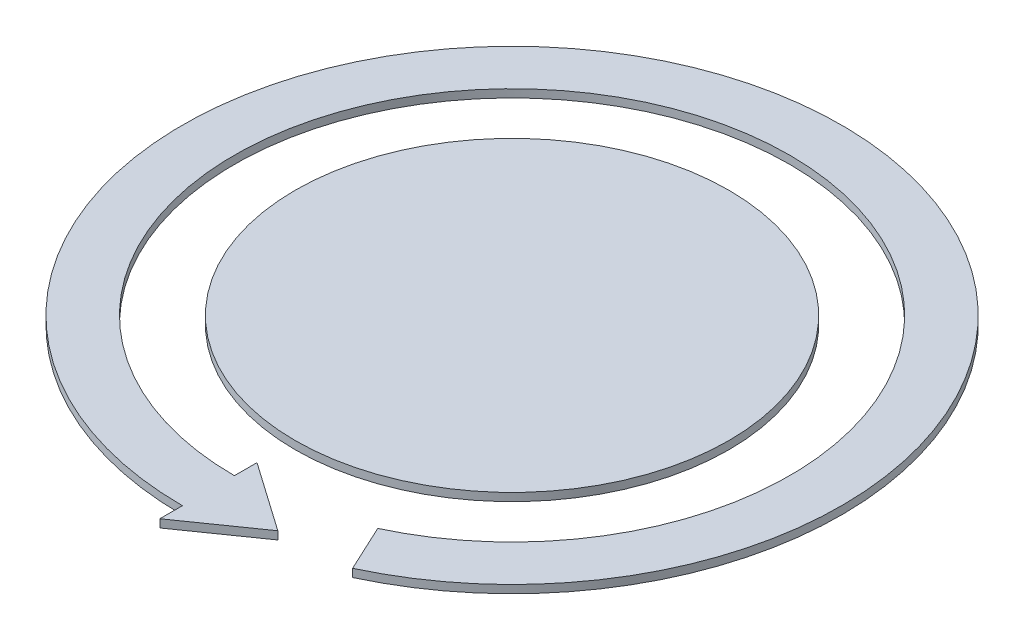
ISO-10303-21;
HEADER;
FILE_DESCRIPTION(('STEP AP214'),'2;1');
FILE_NAME('part.step','',(''),(''),'','','');
FILE_SCHEMA(('AUTOMOTIVE_DESIGN { 1 0 10303 214 1 1 1 1 }'));
ENDSEC;
DATA;
#1=APPLICATION_CONTEXT('core data for automotive mechanical design processes');
#2=APPLICATION_PROTOCOL_DEFINITION('international standard','automotive_design',2000,#1);
#3=PRODUCT_CONTEXT('',#1,'mechanical');
#4=PRODUCT('Part','Part','',(#3));
#5=PRODUCT_RELATED_PRODUCT_CATEGORY('part','',(#4));
#6=PRODUCT_DEFINITION_FORMATION('','',#4);
#7=PRODUCT_DEFINITION_CONTEXT('part definition',#1,'design');
#8=PRODUCT_DEFINITION('design','',#6,#7);
#9=PRODUCT_DEFINITION_SHAPE('','',#8);
#10=(LENGTH_UNIT() NAMED_UNIT(*) SI_UNIT(.MILLI.,.METRE.));
#11=(NAMED_UNIT(*) PLANE_ANGLE_UNIT() SI_UNIT($,.RADIAN.));
#12=(NAMED_UNIT(*) SI_UNIT($,.STERADIAN.) SOLID_ANGLE_UNIT());
#13=UNCERTAINTY_MEASURE_WITH_UNIT(LENGTH_MEASURE(1.E-05),#10,'distance_accuracy_value','');
#14=(GEOMETRIC_REPRESENTATION_CONTEXT(3) GLOBAL_UNCERTAINTY_ASSIGNED_CONTEXT((#13)) GLOBAL_UNIT_ASSIGNED_CONTEXT((#10,
#11,#12)) REPRESENTATION_CONTEXT('',''));
#15=CARTESIAN_POINT('',(0.,0.,0.));
#16=DIRECTION('',(0.,0.,1.));
#17=DIRECTION('',(1.,0.,0.));
#18=AXIS2_PLACEMENT_3D('',#15,#16,#17);
#19=CARTESIAN_POINT('',(0.,2.,0.));
#20=DIRECTION('',(0.,-1.,0.));
#21=DIRECTION('',(0.,0.,-1.));
#22=AXIS2_PLACEMENT_3D('',#19,#20,#21);
#23=CYLINDRICAL_SURFACE('',#22,69.3);
#24=CARTESIAN_POINT('',(0.,0.,0.));
#25=DIRECTION('',(0.,-1.,0.));
#26=DIRECTION('',(0.,0.,1.));
#27=AXIS2_PLACEMENT_3D('',#24,#25,#26);
#28=CIRCLE('',#27,69.3);
#29=CARTESIAN_POINT('',(0.,0.,69.3));
#30=VERTEX_POINT('',#29);
#31=CARTESIAN_POINT('',(29.2874455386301,0.,62.80712964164));
#32=VERTEX_POINT('',#31);
#33=EDGE_CURVE('E133',#30,#32,#28,.T.);
#34=ORIENTED_EDGE('',*,*,#33,.T.);
#35=DIRECTION('',(0.,-1.,0.));
#36=VECTOR('',#35,1.);
#37=CARTESIAN_POINT('',(29.2874455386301,2.,62.80712964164));
#38=LINE('',#37,#36);
#39=CARTESIAN_POINT('',(29.2874455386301,2.,62.80712964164));
#40=VERTEX_POINT('',#39);
#41=EDGE_CURVE('E12',#40,#32,#38,.T.);
#42=ORIENTED_EDGE('',*,*,#41,.F.);
#43=CARTESIAN_POINT('',(0.,2.,0.));
#44=DIRECTION('',(0.,-1.,0.));
#45=DIRECTION('',(0.,0.,1.));
#46=AXIS2_PLACEMENT_3D('',#43,#44,#45);
#47=CIRCLE('',#46,69.3);
#48=CARTESIAN_POINT('',(0.,2.,69.3));
#49=VERTEX_POINT('',#48);
#50=EDGE_CURVE('E145',#49,#40,#47,.T.);
#51=ORIENTED_EDGE('',*,*,#50,.F.);
#52=DIRECTION('',(0.,-1.,0.));
#53=VECTOR('',#52,1.);
#54=CARTESIAN_POINT('',(0.,2.,69.3));
#55=LINE('',#54,#53);
#56=EDGE_CURVE('E129',#49,#30,#55,.T.);
#57=ORIENTED_EDGE('',*,*,#56,.T.);
#58=EDGE_LOOP('',(#34,#42,#51,#57));
#59=FACE_BOUND('',#58,.T.);
#60=ADVANCED_FACE('F43',(#59),#23,.F.);
#61=CARTESIAN_POINT('',(29.2874455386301,2.,62.80712964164));
#62=DIRECTION('',(0.906307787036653,0.,-0.422618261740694));
#63=DIRECTION('',(-0.422618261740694,0.,-0.906307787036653));
#64=AXIS2_PLACEMENT_3D('',#61,#62,#63);
#65=PLANE('',#64);
#66=DIRECTION('',(0.422618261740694,0.,0.906307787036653));
#67=VECTOR('',#66,1.);
#68=CARTESIAN_POINT('',(29.2874455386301,0.,62.80712964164));
#69=LINE('',#68,#67);
#70=CARTESIAN_POINT('',(34.7709174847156,0.,74.5664731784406));
#71=VERTEX_POINT('',#70);
#72=EDGE_CURVE('E136',#32,#71,#69,.T.);
#73=ORIENTED_EDGE('',*,*,#72,.T.);
#74=DIRECTION('',(0.,-1.,0.));
#75=VECTOR('',#74,1.);
#76=CARTESIAN_POINT('',(34.7709174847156,2.,74.5664731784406));
#77=LINE('',#76,#75);
#78=CARTESIAN_POINT('',(34.7709174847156,2.,74.5664731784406));
#79=VERTEX_POINT('',#78);
#80=EDGE_CURVE('E51',#79,#71,#77,.T.);
#81=ORIENTED_EDGE('',*,*,#80,.F.);
#82=DIRECTION('',(0.422618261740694,0.,0.906307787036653));
#83=VECTOR('',#82,1.);
#84=CARTESIAN_POINT('',(29.2874455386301,2.,62.80712964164));
#85=LINE('',#84,#83);
#86=EDGE_CURVE('E99',#40,#79,#85,.T.);
#87=ORIENTED_EDGE('',*,*,#86,.F.);
#88=ORIENTED_EDGE('',*,*,#41,.T.);
#89=EDGE_LOOP('',(#73,#81,#87,#88));
#90=FACE_BOUND('',#89,.T.);
#91=ADVANCED_FACE('F170',(#90),#65,.F.);
#92=CARTESIAN_POINT('',(0.,2.,0.));
#93=DIRECTION('',(0.,-1.,0.));
#94=DIRECTION('',(0.,0.,-1.));
#95=AXIS2_PLACEMENT_3D('',#92,#93,#94);
#96=CYLINDRICAL_SURFACE('',#95,82.275);
#97=CARTESIAN_POINT('',(0.,0.,0.));
#98=DIRECTION('',(0.,1.,0.));
#99=DIRECTION('',(0.,0.,1.));
#100=AXIS2_PLACEMENT_3D('',#97,#98,#99);
#101=CIRCLE('',#100,82.275);
#102=CARTESIAN_POINT('',(0.,0.,82.275));
#103=VERTEX_POINT('',#102);
#104=EDGE_CURVE('E138',#71,#103,#101,.T.);
#105=ORIENTED_EDGE('',*,*,#104,.T.);
#106=DIRECTION('',(0.,-1.,0.));
#107=VECTOR('',#106,1.);
#108=CARTESIAN_POINT('',(0.,2.,82.275));
#109=LINE('',#108,#107);
#110=CARTESIAN_POINT('',(0.,2.,82.275));
#111=VERTEX_POINT('',#110);
#112=EDGE_CURVE('E149',#111,#103,#109,.T.);
#113=ORIENTED_EDGE('',*,*,#112,.F.);
#114=CARTESIAN_POINT('',(0.,2.,0.));
#115=DIRECTION('',(0.,1.,0.));
#116=DIRECTION('',(0.,0.,1.));
#117=AXIS2_PLACEMENT_3D('',#114,#115,#116);
#118=CIRCLE('',#117,82.275);
#119=EDGE_CURVE('E157',#79,#111,#118,.T.);
#120=ORIENTED_EDGE('',*,*,#119,.F.);
#121=ORIENTED_EDGE('',*,*,#80,.T.);
#122=EDGE_LOOP('',(#105,#113,#120,#121));
#123=FACE_BOUND('',#122,.T.);
#124=ADVANCED_FACE('F155',(#123),#96,.T.);
#125=CARTESIAN_POINT('',(0.,2.,87.914111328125));
#126=DIRECTION('',(1.,0.,0.));
#127=DIRECTION('',(0.,0.,-1.));
#128=AXIS2_PLACEMENT_3D('',#125,#126,#127);
#129=PLANE('',#128);
#130=DIRECTION('',(0.,0.,1.));
#131=VECTOR('',#130,1.);
#132=CARTESIAN_POINT('',(0.,0.,87.914111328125));
#133=LINE('',#132,#131);
#134=CARTESIAN_POINT('',(0.,0.,87.914111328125));
#135=VERTEX_POINT('',#134);
#136=EDGE_CURVE('E140',#103,#135,#133,.T.);
#137=ORIENTED_EDGE('',*,*,#136,.T.);
#138=DIRECTION('',(0.,-1.,0.));
#139=VECTOR('',#138,1.);
#140=CARTESIAN_POINT('',(0.,2.,87.914111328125));
#141=LINE('',#140,#139);
#142=CARTESIAN_POINT('',(0.,2.,87.914111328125));
#143=VERTEX_POINT('',#142);
#144=EDGE_CURVE('E124',#143,#135,#141,.T.);
#145=ORIENTED_EDGE('',*,*,#144,.F.);
#146=DIRECTION('',(0.,0.,1.));
#147=VECTOR('',#146,1.);
#148=CARTESIAN_POINT('',(0.,2.,87.914111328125));
#149=LINE('',#148,#147);
#150=EDGE_CURVE('E115',#111,#143,#149,.T.);
#151=ORIENTED_EDGE('',*,*,#150,.F.);
#152=ORIENTED_EDGE('',*,*,#112,.T.);
#153=EDGE_LOOP('',(#137,#145,#151,#152));
#154=FACE_BOUND('',#153,.T.);
#155=ADVANCED_FACE('F163',(#154),#129,.F.);
#156=CARTESIAN_POINT('',(17.3185957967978,2.,75.7875));
#157=DIRECTION('',(-0.57357643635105,0.,-0.819152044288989));
#158=DIRECTION('',(-0.819152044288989,0.,0.57357643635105));
#159=AXIS2_PLACEMENT_3D('',#156,#157,#158);
#160=PLANE('',#159);
#161=DIRECTION('',(0.819152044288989,0.,-0.57357643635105));
#162=VECTOR('',#161,1.);
#163=CARTESIAN_POINT('',(17.3185957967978,0.,75.7875));
#164=LINE('',#163,#162);
#165=CARTESIAN_POINT('',(17.3185957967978,0.,75.7875));
#166=VERTEX_POINT('',#165);
#167=EDGE_CURVE('E123',#135,#166,#164,.T.);
#168=ORIENTED_EDGE('',*,*,#167,.T.);
#169=DIRECTION('',(0.,-1.,0.));
#170=VECTOR('',#169,1.);
#171=CARTESIAN_POINT('',(17.3185957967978,2.,75.7875));
#172=LINE('',#171,#170);
#173=CARTESIAN_POINT('',(17.3185957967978,2.,75.7875));
#174=VERTEX_POINT('',#173);
#175=EDGE_CURVE('E120',#174,#166,#172,.T.);
#176=ORIENTED_EDGE('',*,*,#175,.F.);
#177=DIRECTION('',(0.819152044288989,0.,-0.57357643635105));
#178=VECTOR('',#177,1.);
#179=CARTESIAN_POINT('',(17.3185957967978,2.,75.7875));
#180=LINE('',#179,#178);
#181=EDGE_CURVE('E109',#143,#174,#180,.T.);
#182=ORIENTED_EDGE('',*,*,#181,.F.);
#183=ORIENTED_EDGE('',*,*,#144,.T.);
#184=EDGE_LOOP('',(#168,#176,#182,#183));
#185=FACE_BOUND('',#184,.T.);
#186=ADVANCED_FACE('F121',(#185),#160,.F.);
#187=CARTESIAN_POINT('',(0.,2.,63.660888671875));
#188=DIRECTION('',(-0.57357643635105,0.,0.819152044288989));
#189=DIRECTION('',(0.819152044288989,0.,0.57357643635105));
#190=AXIS2_PLACEMENT_3D('',#187,#188,#189);
#191=PLANE('',#190);
#192=DIRECTION('',(-0.819152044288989,0.,-0.57357643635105));
#193=VECTOR('',#192,1.);
#194=CARTESIAN_POINT('',(0.,0.,63.660888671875));
#195=LINE('',#194,#193);
#196=CARTESIAN_POINT('',(0.,0.,63.660888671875));
#197=VERTEX_POINT('',#196);
#198=EDGE_CURVE('E85',#166,#197,#195,.T.);
#199=ORIENTED_EDGE('',*,*,#198,.T.);
#200=DIRECTION('',(0.,-1.,0.));
#201=VECTOR('',#200,1.);
#202=CARTESIAN_POINT('',(0.,2.,63.660888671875));
#203=LINE('',#202,#201);
#204=CARTESIAN_POINT('',(0.,2.,63.660888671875));
#205=VERTEX_POINT('',#204);
#206=EDGE_CURVE('E125',#205,#197,#203,.T.);
#207=ORIENTED_EDGE('',*,*,#206,.F.);
#208=DIRECTION('',(-0.819152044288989,0.,-0.57357643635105));
#209=VECTOR('',#208,1.);
#210=CARTESIAN_POINT('',(0.,2.,63.660888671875));
#211=LINE('',#210,#209);
#212=EDGE_CURVE('E113',#174,#205,#211,.T.);
#213=ORIENTED_EDGE('',*,*,#212,.F.);
#214=ORIENTED_EDGE('',*,*,#175,.T.);
#215=EDGE_LOOP('',(#199,#207,#213,#214));
#216=FACE_BOUND('',#215,.T.);
#217=ADVANCED_FACE('F127',(#216),#191,.F.);
#218=CARTESIAN_POINT('',(0.,2.,69.3));
#219=DIRECTION('',(1.,0.,0.));
#220=DIRECTION('',(0.,0.,-1.));
#221=AXIS2_PLACEMENT_3D('',#218,#219,#220);
#222=PLANE('',#221);
#223=DIRECTION('',(0.,0.,1.));
#224=VECTOR('',#223,1.);
#225=CARTESIAN_POINT('',(0.,0.,69.3));
#226=LINE('',#225,#224);
#227=EDGE_CURVE('E91',#197,#30,#226,.T.);
#228=ORIENTED_EDGE('',*,*,#227,.T.);
#229=ORIENTED_EDGE('',*,*,#56,.F.);
#230=DIRECTION('',(0.,0.,1.));
#231=VECTOR('',#230,1.);
#232=CARTESIAN_POINT('',(0.,2.,69.3));
#233=LINE('',#232,#231);
#234=EDGE_CURVE('E59',#205,#49,#233,.T.);
#235=ORIENTED_EDGE('',*,*,#234,.F.);
#236=ORIENTED_EDGE('',*,*,#206,.T.);
#237=EDGE_LOOP('',(#228,#229,#235,#236));
#238=FACE_BOUND('',#237,.T.);
#239=ADVANCED_FACE('F184',(#238),#222,.F.);
#240=CARTESIAN_POINT('',(0.,2.,0.));
#241=DIRECTION('',(0.,1.,0.));
#242=DIRECTION('',(0.,0.,1.));
#243=AXIS2_PLACEMENT_3D('',#240,#241,#242);
#244=PLANE('',#243);
#245=ORIENTED_EDGE('',*,*,#50,.T.);
#246=ORIENTED_EDGE('',*,*,#86,.T.);
#247=ORIENTED_EDGE('',*,*,#119,.T.);
#248=ORIENTED_EDGE('',*,*,#150,.T.);
#249=ORIENTED_EDGE('',*,*,#181,.T.);
#250=ORIENTED_EDGE('',*,*,#212,.T.);
#251=ORIENTED_EDGE('',*,*,#234,.T.);
#252=EDGE_LOOP('',(#245,#246,#247,#248,#249,#250,#251));
#253=FACE_BOUND('',#252,.T.);
#254=ADVANCED_FACE('F111',(#253),#244,.T.);
#255=CARTESIAN_POINT('',(0.,0.,0.));
#256=DIRECTION('',(0.,1.,0.));
#257=DIRECTION('',(0.,0.,1.));
#258=AXIS2_PLACEMENT_3D('',#255,#256,#257);
#259=PLANE('',#258);
#260=ORIENTED_EDGE('',*,*,#33,.F.);
#261=ORIENTED_EDGE('',*,*,#227,.F.);
#262=ORIENTED_EDGE('',*,*,#198,.F.);
#263=ORIENTED_EDGE('',*,*,#167,.F.);
#264=ORIENTED_EDGE('',*,*,#136,.F.);
#265=ORIENTED_EDGE('',*,*,#104,.F.);
#266=ORIENTED_EDGE('',*,*,#72,.F.);
#267=EDGE_LOOP('',(#260,#261,#262,#263,#264,#265,#266));
#268=FACE_BOUND('',#267,.T.);
#269=ADVANCED_FACE('F161',(#268),#259,.F.);
#270=CLOSED_SHELL('',(#60,#91,#124,#155,#186,#217,#239,#254,#269));
#271=MANIFOLD_SOLID_BREP('B2',#270);
#272=CARTESIAN_POINT('',(0.,2.,0.));
#273=DIRECTION('',(0.,-1.,0.));
#274=DIRECTION('',(0.,0.,-1.));
#275=AXIS2_PLACEMENT_3D('',#272,#273,#274);
#276=CYLINDRICAL_SURFACE('',#275,54.125);
#277=CARTESIAN_POINT('',(0.,2.,0.));
#278=DIRECTION('',(0.,1.,0.));
#279=DIRECTION('',(0.,0.,1.));
#280=AXIS2_PLACEMENT_3D('',#277,#278,#279);
#281=CIRCLE('',#280,54.125);
#282=CARTESIAN_POINT('',(0.,2.,54.125));
#283=VERTEX_POINT('',#282);
#284=EDGE_CURVE('E42',#283,#283,#281,.T.);
#285=ORIENTED_EDGE('',*,*,#284,.F.);
#286=EDGE_LOOP('',(#285));
#287=FACE_BOUND('',#286,.T.);
#288=CARTESIAN_POINT('',(0.,0.,0.));
#289=DIRECTION('',(0.,1.,0.));
#290=DIRECTION('',(0.,0.,1.));
#291=AXIS2_PLACEMENT_3D('',#288,#289,#290);
#292=CIRCLE('',#291,54.125);
#293=CARTESIAN_POINT('',(0.,0.,54.125));
#294=VERTEX_POINT('',#293);
#295=EDGE_CURVE('E248',#294,#294,#292,.T.);
#296=ORIENTED_EDGE('',*,*,#295,.T.);
#297=EDGE_LOOP('',(#296));
#298=FACE_BOUND('',#297,.T.);
#299=ADVANCED_FACE('F245',(#287,#298),#276,.T.);
#300=CARTESIAN_POINT('',(0.,2.,0.));
#301=DIRECTION('',(0.,1.,0.));
#302=DIRECTION('',(0.,0.,1.));
#303=AXIS2_PLACEMENT_3D('',#300,#301,#302);
#304=PLANE('',#303);
#305=ORIENTED_EDGE('',*,*,#284,.T.);
#306=EDGE_LOOP('',(#305));
#307=FACE_BOUND('',#306,.T.);
#308=ADVANCED_FACE('F260',(#307),#304,.T.);
#309=CARTESIAN_POINT('',(0.,0.,0.));
#310=DIRECTION('',(0.,1.,0.));
#311=DIRECTION('',(0.,0.,1.));
#312=AXIS2_PLACEMENT_3D('',#309,#310,#311);
#313=PLANE('',#312);
#314=ORIENTED_EDGE('',*,*,#295,.F.);
#315=EDGE_LOOP('',(#314));
#316=FACE_BOUND('',#315,.T.);
#317=ADVANCED_FACE('F258',(#316),#313,.F.);
#318=CLOSED_SHELL('',(#299,#308,#317));
#319=MANIFOLD_SOLID_BREP('B6',#318);
#320=ADVANCED_BREP_SHAPE_REPRESENTATION('',(#18,#271,#319),#14);
#321=SHAPE_DEFINITION_REPRESENTATION(#9,#320);
ENDSEC;
END-ISO-10303-21;
